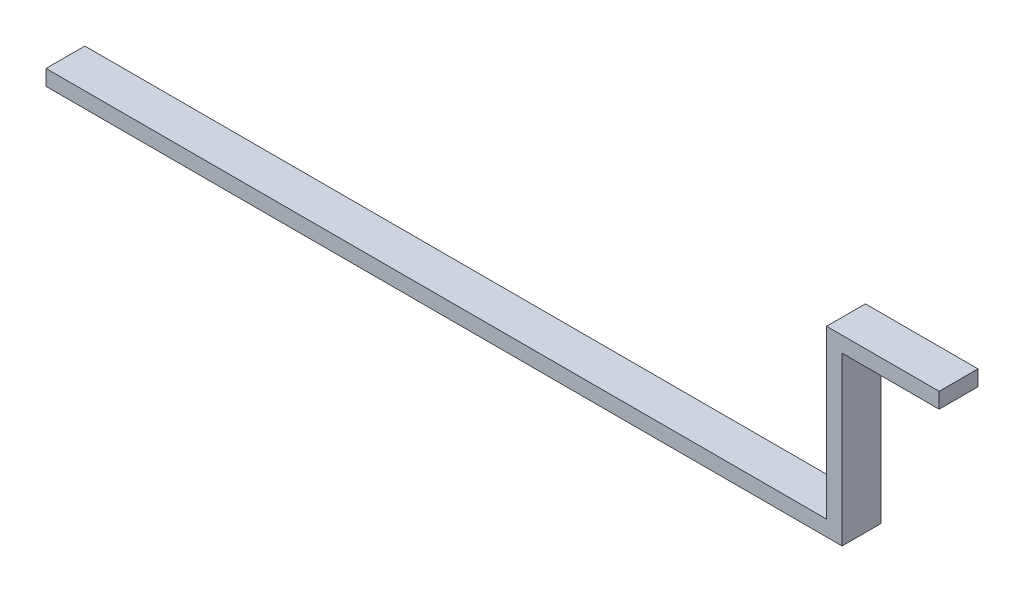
from build123d import *

# Parameters (mm, degrees)
BASE_EXTRUSION_DEPTH = 1


with BuildPart() as part:
    # Esquisse1 → Base-Extrusion (new, symmetric)
    with BuildSketch(Plane.XY):
        Polygon((45, 13.4), (39.2, 13.4), (39.2, 4.8), (-1, 4.8), (-1, 4), (40, 4), (40, 12.6), (45, 12.6), align=None)
    extrude(amount=BASE_EXTRUSION_DEPTH, both=True)


solid = part.part
